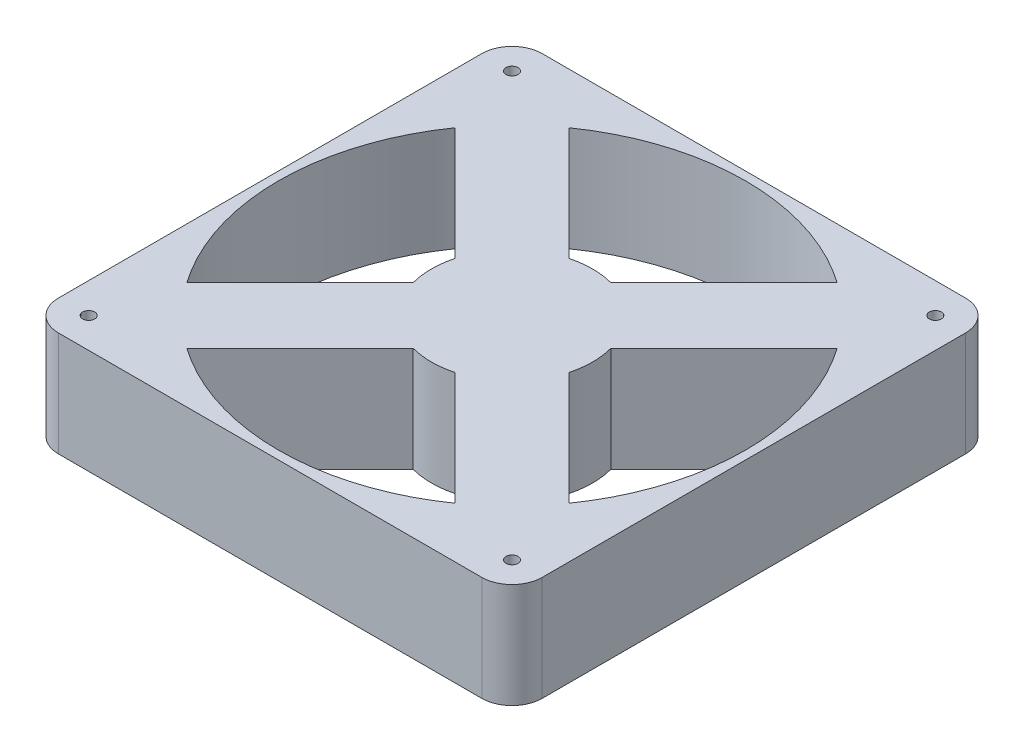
ISO-10303-21;
HEADER;
FILE_DESCRIPTION(('STEP AP214'),'2;1');
FILE_NAME('part.step','',(''),(''),'','','');
FILE_SCHEMA(('AUTOMOTIVE_DESIGN { 1 0 10303 214 1 1 1 1 }'));
ENDSEC;
DATA;
#1=APPLICATION_CONTEXT('core data for automotive mechanical design processes');
#2=APPLICATION_PROTOCOL_DEFINITION('international standard','automotive_design',2000,#1);
#3=PRODUCT_CONTEXT('',#1,'mechanical');
#4=PRODUCT('Part','Part','',(#3));
#5=PRODUCT_RELATED_PRODUCT_CATEGORY('part','',(#4));
#6=PRODUCT_DEFINITION_FORMATION('','',#4);
#7=PRODUCT_DEFINITION_CONTEXT('part definition',#1,'design');
#8=PRODUCT_DEFINITION('design','',#6,#7);
#9=PRODUCT_DEFINITION_SHAPE('','',#8);
#10=(LENGTH_UNIT() NAMED_UNIT(*) SI_UNIT(.MILLI.,.METRE.));
#11=(NAMED_UNIT(*) PLANE_ANGLE_UNIT() SI_UNIT($,.RADIAN.));
#12=(NAMED_UNIT(*) SI_UNIT($,.STERADIAN.) SOLID_ANGLE_UNIT());
#13=UNCERTAINTY_MEASURE_WITH_UNIT(LENGTH_MEASURE(1.E-05),#10,'distance_accuracy_value','');
#14=(GEOMETRIC_REPRESENTATION_CONTEXT(3) GLOBAL_UNCERTAINTY_ASSIGNED_CONTEXT((#13)) GLOBAL_UNIT_ASSIGNED_CONTEXT((#10,
#11,#12)) REPRESENTATION_CONTEXT('',''));
#15=CARTESIAN_POINT('',(0.,0.,0.));
#16=DIRECTION('',(0.,0.,1.));
#17=DIRECTION('',(1.,0.,0.));
#18=AXIS2_PLACEMENT_3D('',#15,#16,#17);
#19=CARTESIAN_POINT('',(-52.5,26.,52.5));
#20=DIRECTION('',(0.,1.,0.));
#21=DIRECTION('',(0.,0.,1.));
#22=AXIS2_PLACEMENT_3D('',#19,#20,#21);
#23=PLANE('',#22);
#24=DIRECTION('',(-0.707106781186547,0.,-0.707106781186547));
#25=VECTOR('',#24,1.);
#26=CARTESIAN_POINT('',(5.17638090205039,26.,19.3185165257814));
#27=LINE('',#26,#25);
#28=CARTESIAN_POINT('',(33.2508237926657,26.,47.3929594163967));
#29=VERTEX_POINT('',#28);
#30=CARTESIAN_POINT('',(5.17638090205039,26.,19.3185165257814));
#31=VERTEX_POINT('',#30);
#32=EDGE_CURVE('E232',#29,#31,#27,.T.);
#33=ORIENTED_EDGE('',*,*,#32,.F.);
#34=CARTESIAN_POINT('',(0.,26.,0.));
#35=DIRECTION('',(0.,1.,0.));
#36=DIRECTION('',(0.,0.,1.));
#37=AXIS2_PLACEMENT_3D('',#34,#35,#36);
#38=CIRCLE('',#37,57.8939537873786);
#39=CARTESIAN_POINT('',(-33.2508237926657,26.,47.3929594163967));
#40=VERTEX_POINT('',#39);
#41=EDGE_CURVE('E230',#40,#29,#38,.T.);
#42=ORIENTED_EDGE('',*,*,#41,.F.);
#43=DIRECTION('',(-0.707106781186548,0.,0.707106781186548));
#44=VECTOR('',#43,1.);
#45=CARTESIAN_POINT('',(-5.17638090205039,26.,19.3185165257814));
#46=LINE('',#45,#44);
#47=CARTESIAN_POINT('',(-5.17638090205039,26.,19.3185165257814));
#48=VERTEX_POINT('',#47);
#49=EDGE_CURVE('E238',#48,#40,#46,.T.);
#50=ORIENTED_EDGE('',*,*,#49,.F.);
#51=CARTESIAN_POINT('',(0.,26.,0.));
#52=DIRECTION('',(0.,-1.,0.));
#53=DIRECTION('',(0.,0.,1.));
#54=AXIS2_PLACEMENT_3D('',#51,#52,#53);
#55=CIRCLE('',#54,20.);
#56=EDGE_CURVE('E235',#31,#48,#55,.T.);
#57=ORIENTED_EDGE('',*,*,#56,.F.);
#58=EDGE_LOOP('',(#33,#42,#50,#57));
#59=FACE_BOUND('',#58,.T.);
#60=CARTESIAN_POINT('',(52.5,26.,52.5));
#61=DIRECTION('',(0.,1.,0.));
#62=DIRECTION('',(0.,0.,1.));
#63=AXIS2_PLACEMENT_3D('',#60,#61,#62);
#64=CIRCLE('',#63,1.5);
#65=CARTESIAN_POINT('',(52.5,26.,51.));
#66=VERTEX_POINT('',#65);
#67=EDGE_CURVE('E292',#66,#66,#64,.T.);
#68=ORIENTED_EDGE('',*,*,#67,.F.);
#69=EDGE_LOOP('',(#68));
#70=FACE_BOUND('',#69,.T.);
#71=CARTESIAN_POINT('',(52.5,26.,-52.5));
#72=DIRECTION('',(0.,1.,0.));
#73=DIRECTION('',(0.,0.,-1.));
#74=AXIS2_PLACEMENT_3D('',#71,#72,#73);
#75=CIRCLE('',#74,1.5);
#76=CARTESIAN_POINT('',(52.5,26.,-54.));
#77=VERTEX_POINT('',#76);
#78=EDGE_CURVE('E304',#77,#77,#75,.T.);
#79=ORIENTED_EDGE('',*,*,#78,.F.);
#80=EDGE_LOOP('',(#79));
#81=FACE_BOUND('',#80,.T.);
#82=DIRECTION('',(0.707106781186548,0.,0.707106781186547));
#83=VECTOR('',#82,1.);
#84=CARTESIAN_POINT('',(19.3185165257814,26.,5.17638090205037));
#85=LINE('',#84,#83);
#86=CARTESIAN_POINT('',(19.3185165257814,26.,5.17638090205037));
#87=VERTEX_POINT('',#86);
#88=CARTESIAN_POINT('',(47.3929594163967,26.,33.2508237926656));
#89=VERTEX_POINT('',#88);
#90=EDGE_CURVE('E318',#87,#89,#85,.T.);
#91=ORIENTED_EDGE('',*,*,#90,.F.);
#92=CARTESIAN_POINT('',(0.,26.,0.));
#93=DIRECTION('',(0.,-1.,0.));
#94=DIRECTION('',(0.,0.,-1.));
#95=AXIS2_PLACEMENT_3D('',#92,#93,#94);
#96=CIRCLE('',#95,20.);
#97=CARTESIAN_POINT('',(19.3185165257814,26.,-5.17638090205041));
#98=VERTEX_POINT('',#97);
#99=EDGE_CURVE('E316',#98,#87,#96,.T.);
#100=ORIENTED_EDGE('',*,*,#99,.F.);
#101=DIRECTION('',(-0.707106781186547,0.,0.707106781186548));
#102=VECTOR('',#101,1.);
#103=CARTESIAN_POINT('',(19.3185165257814,26.,-5.17638090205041));
#104=LINE('',#103,#102);
#105=CARTESIAN_POINT('',(47.3929594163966,26.,-33.2508237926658));
#106=VERTEX_POINT('',#105);
#107=EDGE_CURVE('E324',#106,#98,#104,.T.);
#108=ORIENTED_EDGE('',*,*,#107,.F.);
#109=CARTESIAN_POINT('',(0.,26.,0.));
#110=DIRECTION('',(0.,1.,0.));
#111=DIRECTION('',(0.,0.,-1.));
#112=AXIS2_PLACEMENT_3D('',#109,#110,#111);
#113=CIRCLE('',#112,57.8939537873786);
#114=EDGE_CURVE('E321',#89,#106,#113,.T.);
#115=ORIENTED_EDGE('',*,*,#114,.F.);
#116=EDGE_LOOP('',(#91,#100,#108,#115));
#117=FACE_BOUND('',#116,.T.);
#118=CARTESIAN_POINT('',(-52.5,26.,52.5));
#119=DIRECTION('',(0.,1.,0.));
#120=DIRECTION('',(0.,0.,1.));
#121=AXIS2_PLACEMENT_3D('',#118,#119,#120);
#122=CIRCLE('',#121,7.5);
#123=CARTESIAN_POINT('',(-60.,26.,52.5));
#124=VERTEX_POINT('',#123);
#125=CARTESIAN_POINT('',(-52.5,26.,60.));
#126=VERTEX_POINT('',#125);
#127=EDGE_CURVE('E347',#124,#126,#122,.T.);
#128=ORIENTED_EDGE('',*,*,#127,.T.);
#129=DIRECTION('',(1.,0.,0.));
#130=VECTOR('',#129,1.);
#131=CARTESIAN_POINT('',(-52.5,26.,60.));
#132=LINE('',#131,#130);
#133=CARTESIAN_POINT('',(52.5,26.,60.));
#134=VERTEX_POINT('',#133);
#135=EDGE_CURVE('E350',#126,#134,#132,.T.);
#136=ORIENTED_EDGE('',*,*,#135,.T.);
#137=CARTESIAN_POINT('',(52.5,26.,52.5));
#138=DIRECTION('',(0.,1.,0.));
#139=DIRECTION('',(0.,0.,1.));
#140=AXIS2_PLACEMENT_3D('',#137,#138,#139);
#141=CIRCLE('',#140,7.5);
#142=CARTESIAN_POINT('',(60.,26.,52.5));
#143=VERTEX_POINT('',#142);
#144=EDGE_CURVE('E353',#134,#143,#141,.T.);
#145=ORIENTED_EDGE('',*,*,#144,.T.);
#146=DIRECTION('',(0.,0.,-1.));
#147=VECTOR('',#146,1.);
#148=CARTESIAN_POINT('',(60.,26.,-52.5));
#149=LINE('',#148,#147);
#150=CARTESIAN_POINT('',(60.,26.,-52.5));
#151=VERTEX_POINT('',#150);
#152=EDGE_CURVE('E355',#143,#151,#149,.T.);
#153=ORIENTED_EDGE('',*,*,#152,.T.);
#154=CARTESIAN_POINT('',(52.5,26.,-52.5));
#155=DIRECTION('',(0.,1.,0.));
#156=DIRECTION('',(0.,0.,-1.));
#157=AXIS2_PLACEMENT_3D('',#154,#155,#156);
#158=CIRCLE('',#157,7.5);
#159=CARTESIAN_POINT('',(52.5,26.,-60.));
#160=VERTEX_POINT('',#159);
#161=EDGE_CURVE('E357',#151,#160,#158,.T.);
#162=ORIENTED_EDGE('',*,*,#161,.T.);
#163=DIRECTION('',(-1.,0.,0.));
#164=VECTOR('',#163,1.);
#165=CARTESIAN_POINT('',(-52.5,26.,-60.));
#166=LINE('',#165,#164);
#167=CARTESIAN_POINT('',(-52.5,26.,-60.));
#168=VERTEX_POINT('',#167);
#169=EDGE_CURVE('E359',#160,#168,#166,.T.);
#170=ORIENTED_EDGE('',*,*,#169,.T.);
#171=CARTESIAN_POINT('',(-52.5,26.,-52.5));
#172=DIRECTION('',(0.,1.,0.));
#173=DIRECTION('',(0.,0.,-1.));
#174=AXIS2_PLACEMENT_3D('',#171,#172,#173);
#175=CIRCLE('',#174,7.5);
#176=CARTESIAN_POINT('',(-60.,26.,-52.5));
#177=VERTEX_POINT('',#176);
#178=EDGE_CURVE('E361',#168,#177,#175,.T.);
#179=ORIENTED_EDGE('',*,*,#178,.T.);
#180=DIRECTION('',(0.,0.,1.));
#181=VECTOR('',#180,1.);
#182=CARTESIAN_POINT('',(-60.,26.,-52.5));
#183=LINE('',#182,#181);
#184=EDGE_CURVE('E363',#177,#124,#183,.T.);
#185=ORIENTED_EDGE('',*,*,#184,.T.);
#186=EDGE_LOOP('',(#128,#136,#145,#153,#162,#170,#179,#185));
#187=FACE_BOUND('',#186,.T.);
#188=CARTESIAN_POINT('',(-52.5,26.,-52.5));
#189=DIRECTION('',(0.,1.,0.));
#190=DIRECTION('',(0.,0.,1.));
#191=AXIS2_PLACEMENT_3D('',#188,#189,#190);
#192=CIRCLE('',#191,1.5);
#193=CARTESIAN_POINT('',(-52.5,26.,-54.));
#194=VERTEX_POINT('',#193);
#195=EDGE_CURVE('E310',#194,#194,#192,.T.);
#196=ORIENTED_EDGE('',*,*,#195,.F.);
#197=EDGE_LOOP('',(#196));
#198=FACE_BOUND('',#197,.T.);
#199=CARTESIAN_POINT('',(-52.5,26.,52.5));
#200=DIRECTION('',(0.,1.,0.));
#201=DIRECTION('',(0.,0.,-1.));
#202=AXIS2_PLACEMENT_3D('',#199,#200,#201);
#203=CIRCLE('',#202,1.49999999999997);
#204=CARTESIAN_POINT('',(-52.5,26.,51.));
#205=VERTEX_POINT('',#204);
#206=EDGE_CURVE('E298',#205,#205,#203,.T.);
#207=ORIENTED_EDGE('',*,*,#206,.F.);
#208=EDGE_LOOP('',(#207));
#209=FACE_BOUND('',#208,.T.);
#210=DIRECTION('',(0.707106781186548,0.,0.707106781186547));
#211=VECTOR('',#210,1.);
#212=CARTESIAN_POINT('',(-33.2508237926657,26.,-47.3929594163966));
#213=LINE('',#212,#211);
#214=CARTESIAN_POINT('',(-33.2508237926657,26.,-47.3929594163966));
#215=VERTEX_POINT('',#214);
#216=CARTESIAN_POINT('',(-5.17638090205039,26.,-19.3185165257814));
#217=VERTEX_POINT('',#216);
#218=EDGE_CURVE('E263',#215,#217,#213,.T.);
#219=ORIENTED_EDGE('',*,*,#218,.F.);
#220=CARTESIAN_POINT('',(0.,26.,0.));
#221=DIRECTION('',(0.,1.,0.));
#222=DIRECTION('',(0.,0.,-1.));
#223=AXIS2_PLACEMENT_3D('',#220,#221,#222);
#224=CIRCLE('',#223,57.8939537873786);
#225=CARTESIAN_POINT('',(33.2508237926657,26.,-47.3929594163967));
#226=VERTEX_POINT('',#225);
#227=EDGE_CURVE('E261',#226,#215,#224,.T.);
#228=ORIENTED_EDGE('',*,*,#227,.F.);
#229=DIRECTION('',(0.707106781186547,0.,-0.707106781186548));
#230=VECTOR('',#229,1.);
#231=CARTESIAN_POINT('',(5.17638090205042,26.,-19.3185165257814));
#232=LINE('',#231,#230);
#233=CARTESIAN_POINT('',(5.17638090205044,26.,-19.3185165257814));
#234=VERTEX_POINT('',#233);
#235=EDGE_CURVE('E269',#234,#226,#232,.T.);
#236=ORIENTED_EDGE('',*,*,#235,.F.);
#237=CARTESIAN_POINT('',(0.,26.,0.));
#238=DIRECTION('',(0.,-1.,0.));
#239=DIRECTION('',(0.,0.,-1.));
#240=AXIS2_PLACEMENT_3D('',#237,#238,#239);
#241=CIRCLE('',#240,20.);
#242=EDGE_CURVE('E266',#217,#234,#241,.T.);
#243=ORIENTED_EDGE('',*,*,#242,.F.);
#244=EDGE_LOOP('',(#219,#228,#236,#243));
#245=FACE_BOUND('',#244,.T.);
#246=DIRECTION('',(0.707106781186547,0.,-0.707106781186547));
#247=VECTOR('',#246,1.);
#248=CARTESIAN_POINT('',(-19.3185165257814,26.,5.17638090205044));
#249=LINE('',#248,#247);
#250=CARTESIAN_POINT('',(-47.3929594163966,26.,33.2508237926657));
#251=VERTEX_POINT('',#250);
#252=CARTESIAN_POINT('',(-19.3185165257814,26.,5.17638090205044));
#253=VERTEX_POINT('',#252);
#254=EDGE_CURVE('E202',#251,#253,#249,.T.);
#255=ORIENTED_EDGE('',*,*,#254,.F.);
#256=CARTESIAN_POINT('',(0.,26.,0.));
#257=DIRECTION('',(0.,1.,0.));
#258=DIRECTION('',(0.,0.,1.));
#259=AXIS2_PLACEMENT_3D('',#256,#257,#258);
#260=CIRCLE('',#259,57.8939537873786);
#261=CARTESIAN_POINT('',(-47.3929594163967,26.,-33.2508237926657));
#262=VERTEX_POINT('',#261);
#263=EDGE_CURVE('E194',#262,#251,#260,.T.);
#264=ORIENTED_EDGE('',*,*,#263,.F.);
#265=DIRECTION('',(-0.707106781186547,0.,-0.707106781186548));
#266=VECTOR('',#265,1.);
#267=CARTESIAN_POINT('',(-47.3929594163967,26.,-33.2508237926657));
#268=LINE('',#267,#266);
#269=CARTESIAN_POINT('',(-19.3185165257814,26.,-5.1763809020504));
#270=VERTEX_POINT('',#269);
#271=EDGE_CURVE('E216',#270,#262,#268,.T.);
#272=ORIENTED_EDGE('',*,*,#271,.F.);
#273=CARTESIAN_POINT('',(0.,26.,0.));
#274=DIRECTION('',(0.,-1.,0.));
#275=DIRECTION('',(0.,0.,1.));
#276=AXIS2_PLACEMENT_3D('',#273,#274,#275);
#277=CIRCLE('',#276,20.);
#278=EDGE_CURVE('E214',#253,#270,#277,.T.);
#279=ORIENTED_EDGE('',*,*,#278,.F.);
#280=EDGE_LOOP('',(#255,#264,#272,#279));
#281=FACE_BOUND('',#280,.T.);
#282=ADVANCED_FACE('F33',(#59,#70,#81,#117,#187,#198,#209,#245,#281),#23,.T.);
#283=CARTESIAN_POINT('',(-52.5,0.,52.5));
#284=DIRECTION('',(0.,1.,0.));
#285=DIRECTION('',(0.,0.,1.));
#286=AXIS2_PLACEMENT_3D('',#283,#284,#285);
#287=PLANE('',#286);
#288=CARTESIAN_POINT('',(0.,0.,0.));
#289=DIRECTION('',(0.,1.,0.));
#290=DIRECTION('',(0.,0.,1.));
#291=AXIS2_PLACEMENT_3D('',#288,#289,#290);
#292=CIRCLE('',#291,57.8939537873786);
#293=CARTESIAN_POINT('',(-33.2508237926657,0.,47.3929594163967));
#294=VERTEX_POINT('',#293);
#295=CARTESIAN_POINT('',(33.2508237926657,0.,47.3929594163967));
#296=VERTEX_POINT('',#295);
#297=EDGE_CURVE('E210',#294,#296,#292,.T.);
#298=ORIENTED_EDGE('',*,*,#297,.T.);
#299=DIRECTION('',(-0.707106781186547,0.,-0.707106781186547));
#300=VECTOR('',#299,1.);
#301=CARTESIAN_POINT('',(5.17638090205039,0.,19.3185165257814));
#302=LINE('',#301,#300);
#303=CARTESIAN_POINT('',(5.17638090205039,0.,19.3185165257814));
#304=VERTEX_POINT('',#303);
#305=EDGE_CURVE('E243',#296,#304,#302,.T.);
#306=ORIENTED_EDGE('',*,*,#305,.T.);
#307=CARTESIAN_POINT('',(0.,0.,0.));
#308=DIRECTION('',(0.,-1.,0.));
#309=DIRECTION('',(0.,0.,1.));
#310=AXIS2_PLACEMENT_3D('',#307,#308,#309);
#311=CIRCLE('',#310,20.);
#312=CARTESIAN_POINT('',(-5.17638090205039,0.,19.3185165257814));
#313=VERTEX_POINT('',#312);
#314=EDGE_CURVE('E246',#304,#313,#311,.T.);
#315=ORIENTED_EDGE('',*,*,#314,.T.);
#316=DIRECTION('',(-0.707106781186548,0.,0.707106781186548));
#317=VECTOR('',#316,1.);
#318=CARTESIAN_POINT('',(-5.17638090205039,0.,19.3185165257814));
#319=LINE('',#318,#317);
#320=EDGE_CURVE('E233',#313,#294,#319,.T.);
#321=ORIENTED_EDGE('',*,*,#320,.T.);
#322=EDGE_LOOP('',(#298,#306,#315,#321));
#323=FACE_BOUND('',#322,.T.);
#324=CARTESIAN_POINT('',(52.5,0.,52.5));
#325=DIRECTION('',(0.,1.,0.));
#326=DIRECTION('',(0.,0.,1.));
#327=AXIS2_PLACEMENT_3D('',#324,#325,#326);
#328=CIRCLE('',#327,1.5);
#329=CARTESIAN_POINT('',(52.5,0.,51.));
#330=VERTEX_POINT('',#329);
#331=EDGE_CURVE('E291',#330,#330,#328,.T.);
#332=ORIENTED_EDGE('',*,*,#331,.T.);
#333=EDGE_LOOP('',(#332));
#334=FACE_BOUND('',#333,.T.);
#335=CARTESIAN_POINT('',(52.5,0.,-52.5));
#336=DIRECTION('',(0.,1.,0.));
#337=DIRECTION('',(0.,0.,-1.));
#338=AXIS2_PLACEMENT_3D('',#335,#336,#337);
#339=CIRCLE('',#338,1.5);
#340=CARTESIAN_POINT('',(52.5,0.,-54.));
#341=VERTEX_POINT('',#340);
#342=EDGE_CURVE('E301',#341,#341,#339,.T.);
#343=ORIENTED_EDGE('',*,*,#342,.T.);
#344=EDGE_LOOP('',(#343));
#345=FACE_BOUND('',#344,.T.);
#346=CARTESIAN_POINT('',(0.,0.,0.));
#347=DIRECTION('',(0.,-1.,0.));
#348=DIRECTION('',(0.,0.,-1.));
#349=AXIS2_PLACEMENT_3D('',#346,#347,#348);
#350=CIRCLE('',#349,20.);
#351=CARTESIAN_POINT('',(19.3185165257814,0.,-5.17638090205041));
#352=VERTEX_POINT('',#351);
#353=CARTESIAN_POINT('',(19.3185165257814,0.,5.17638090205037));
#354=VERTEX_POINT('',#353);
#355=EDGE_CURVE('E313',#352,#354,#350,.T.);
#356=ORIENTED_EDGE('',*,*,#355,.T.);
#357=DIRECTION('',(0.707106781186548,0.,0.707106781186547));
#358=VECTOR('',#357,1.);
#359=CARTESIAN_POINT('',(19.3185165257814,0.,5.17638090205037));
#360=LINE('',#359,#358);
#361=CARTESIAN_POINT('',(47.3929594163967,0.,33.2508237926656));
#362=VERTEX_POINT('',#361);
#363=EDGE_CURVE('E329',#354,#362,#360,.T.);
#364=ORIENTED_EDGE('',*,*,#363,.T.);
#365=CARTESIAN_POINT('',(0.,0.,0.));
#366=DIRECTION('',(0.,1.,0.));
#367=DIRECTION('',(0.,0.,-1.));
#368=AXIS2_PLACEMENT_3D('',#365,#366,#367);
#369=CIRCLE('',#368,57.8939537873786);
#370=CARTESIAN_POINT('',(47.3929594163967,0.,-33.2508237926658));
#371=VERTEX_POINT('',#370);
#372=EDGE_CURVE('E332',#362,#371,#369,.T.);
#373=ORIENTED_EDGE('',*,*,#372,.T.);
#374=DIRECTION('',(-0.707106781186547,0.,0.707106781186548));
#375=VECTOR('',#374,1.);
#376=CARTESIAN_POINT('',(19.3185165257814,0.,-5.17638090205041));
#377=LINE('',#376,#375);
#378=EDGE_CURVE('E319',#371,#352,#377,.T.);
#379=ORIENTED_EDGE('',*,*,#378,.T.);
#380=EDGE_LOOP('',(#356,#364,#373,#379));
#381=FACE_BOUND('',#380,.T.);
#382=CARTESIAN_POINT('',(-52.5,0.,52.5));
#383=DIRECTION('',(0.,1.,0.));
#384=DIRECTION('',(0.,0.,1.));
#385=AXIS2_PLACEMENT_3D('',#382,#383,#384);
#386=CIRCLE('',#385,7.5);
#387=CARTESIAN_POINT('',(-60.,0.,52.5));
#388=VERTEX_POINT('',#387);
#389=CARTESIAN_POINT('',(-52.5,0.,60.));
#390=VERTEX_POINT('',#389);
#391=EDGE_CURVE('E346',#388,#390,#386,.T.);
#392=ORIENTED_EDGE('',*,*,#391,.F.);
#393=DIRECTION('',(0.,0.,1.));
#394=VECTOR('',#393,1.);
#395=CARTESIAN_POINT('',(-60.,0.,-52.5));
#396=LINE('',#395,#394);
#397=CARTESIAN_POINT('',(-60.,0.,-52.5));
#398=VERTEX_POINT('',#397);
#399=EDGE_CURVE('E351',#398,#388,#396,.T.);
#400=ORIENTED_EDGE('',*,*,#399,.F.);
#401=CARTESIAN_POINT('',(-52.5,0.,-52.5));
#402=DIRECTION('',(0.,1.,0.));
#403=DIRECTION('',(0.,0.,-1.));
#404=AXIS2_PLACEMENT_3D('',#401,#402,#403);
#405=CIRCLE('',#404,7.5);
#406=CARTESIAN_POINT('',(-52.5,0.,-60.));
#407=VERTEX_POINT('',#406);
#408=EDGE_CURVE('E378',#407,#398,#405,.T.);
#409=ORIENTED_EDGE('',*,*,#408,.F.);
#410=DIRECTION('',(-1.,0.,0.));
#411=VECTOR('',#410,1.);
#412=CARTESIAN_POINT('',(-52.5,0.,-60.));
#413=LINE('',#412,#411);
#414=CARTESIAN_POINT('',(52.5,0.,-60.));
#415=VERTEX_POINT('',#414);
#416=EDGE_CURVE('E376',#415,#407,#413,.T.);
#417=ORIENTED_EDGE('',*,*,#416,.F.);
#418=CARTESIAN_POINT('',(52.5,0.,-52.5));
#419=DIRECTION('',(0.,1.,0.));
#420=DIRECTION('',(0.,0.,-1.));
#421=AXIS2_PLACEMENT_3D('',#418,#419,#420);
#422=CIRCLE('',#421,7.5);
#423=CARTESIAN_POINT('',(60.,0.,-52.5));
#424=VERTEX_POINT('',#423);
#425=EDGE_CURVE('E374',#424,#415,#422,.T.);
#426=ORIENTED_EDGE('',*,*,#425,.F.);
#427=DIRECTION('',(0.,0.,-1.));
#428=VECTOR('',#427,1.);
#429=CARTESIAN_POINT('',(60.,0.,-52.5));
#430=LINE('',#429,#428);
#431=CARTESIAN_POINT('',(60.,0.,52.5));
#432=VERTEX_POINT('',#431);
#433=EDGE_CURVE('E372',#432,#424,#430,.T.);
#434=ORIENTED_EDGE('',*,*,#433,.F.);
#435=CARTESIAN_POINT('',(52.5,0.,52.5));
#436=DIRECTION('',(0.,1.,0.));
#437=DIRECTION('',(0.,0.,1.));
#438=AXIS2_PLACEMENT_3D('',#435,#436,#437);
#439=CIRCLE('',#438,7.5);
#440=CARTESIAN_POINT('',(52.5,0.,60.));
#441=VERTEX_POINT('',#440);
#442=EDGE_CURVE('E370',#441,#432,#439,.T.);
#443=ORIENTED_EDGE('',*,*,#442,.F.);
#444=DIRECTION('',(1.,0.,0.));
#445=VECTOR('',#444,1.);
#446=CARTESIAN_POINT('',(-52.5,0.,60.));
#447=LINE('',#446,#445);
#448=EDGE_CURVE('E368',#390,#441,#447,.T.);
#449=ORIENTED_EDGE('',*,*,#448,.F.);
#450=EDGE_LOOP('',(#392,#400,#409,#417,#426,#434,#443,#449));
#451=FACE_BOUND('',#450,.T.);
#452=CARTESIAN_POINT('',(-52.5,0.,-52.5));
#453=DIRECTION('',(0.,1.,0.));
#454=DIRECTION('',(0.,0.,1.));
#455=AXIS2_PLACEMENT_3D('',#452,#453,#454);
#456=CIRCLE('',#455,1.5);
#457=CARTESIAN_POINT('',(-52.5,0.,-54.));
#458=VERTEX_POINT('',#457);
#459=EDGE_CURVE('E307',#458,#458,#456,.T.);
#460=ORIENTED_EDGE('',*,*,#459,.T.);
#461=EDGE_LOOP('',(#460));
#462=FACE_BOUND('',#461,.T.);
#463=CARTESIAN_POINT('',(-52.5,0.,52.5));
#464=DIRECTION('',(0.,1.,0.));
#465=DIRECTION('',(0.,0.,-1.));
#466=AXIS2_PLACEMENT_3D('',#463,#464,#465);
#467=CIRCLE('',#466,1.49999999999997);
#468=CARTESIAN_POINT('',(-52.5,0.,51.));
#469=VERTEX_POINT('',#468);
#470=EDGE_CURVE('E295',#469,#469,#467,.T.);
#471=ORIENTED_EDGE('',*,*,#470,.T.);
#472=EDGE_LOOP('',(#471));
#473=FACE_BOUND('',#472,.T.);
#474=CARTESIAN_POINT('',(0.,0.,0.));
#475=DIRECTION('',(0.,1.,0.));
#476=DIRECTION('',(0.,0.,-1.));
#477=AXIS2_PLACEMENT_3D('',#474,#475,#476);
#478=CIRCLE('',#477,57.8939537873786);
#479=CARTESIAN_POINT('',(33.2508237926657,0.,-47.3929594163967));
#480=VERTEX_POINT('',#479);
#481=CARTESIAN_POINT('',(-33.2508237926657,0.,-47.3929594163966));
#482=VERTEX_POINT('',#481);
#483=EDGE_CURVE('E260',#480,#482,#478,.T.);
#484=ORIENTED_EDGE('',*,*,#483,.T.);
#485=DIRECTION('',(0.707106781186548,0.,0.707106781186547));
#486=VECTOR('',#485,1.);
#487=CARTESIAN_POINT('',(-33.2508237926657,0.,-47.3929594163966));
#488=LINE('',#487,#486);
#489=CARTESIAN_POINT('',(-5.17638090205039,0.,-19.3185165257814));
#490=VERTEX_POINT('',#489);
#491=EDGE_CURVE('E274',#482,#490,#488,.T.);
#492=ORIENTED_EDGE('',*,*,#491,.T.);
#493=CARTESIAN_POINT('',(0.,0.,0.));
#494=DIRECTION('',(0.,-1.,0.));
#495=DIRECTION('',(0.,0.,-1.));
#496=AXIS2_PLACEMENT_3D('',#493,#494,#495);
#497=CIRCLE('',#496,20.);
#498=CARTESIAN_POINT('',(5.17638090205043,0.,-19.3185165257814));
#499=VERTEX_POINT('',#498);
#500=EDGE_CURVE('E277',#490,#499,#497,.T.);
#501=ORIENTED_EDGE('',*,*,#500,.T.);
#502=DIRECTION('',(0.707106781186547,0.,-0.707106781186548));
#503=VECTOR('',#502,1.);
#504=CARTESIAN_POINT('',(5.17638090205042,0.,-19.3185165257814));
#505=LINE('',#504,#503);
#506=EDGE_CURVE('E264',#499,#480,#505,.T.);
#507=ORIENTED_EDGE('',*,*,#506,.T.);
#508=EDGE_LOOP('',(#484,#492,#501,#507));
#509=FACE_BOUND('',#508,.T.);
#510=CARTESIAN_POINT('',(0.,0.,0.));
#511=DIRECTION('',(0.,1.,0.));
#512=DIRECTION('',(0.,0.,1.));
#513=AXIS2_PLACEMENT_3D('',#510,#511,#512);
#514=CIRCLE('',#513,57.8939537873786);
#515=CARTESIAN_POINT('',(-47.3929594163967,0.,-33.2508237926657));
#516=VERTEX_POINT('',#515);
#517=CARTESIAN_POINT('',(-47.3929594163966,0.,33.2508237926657));
#518=VERTEX_POINT('',#517);
#519=EDGE_CURVE('E56',#516,#518,#514,.T.);
#520=ORIENTED_EDGE('',*,*,#519,.T.);
#521=DIRECTION('',(0.707106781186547,0.,-0.707106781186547));
#522=VECTOR('',#521,1.);
#523=CARTESIAN_POINT('',(-19.3185165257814,0.,5.17638090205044));
#524=LINE('',#523,#522);
#525=CARTESIAN_POINT('',(-19.3185165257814,0.,5.17638090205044));
#526=VERTEX_POINT('',#525);
#527=EDGE_CURVE('E209',#518,#526,#524,.T.);
#528=ORIENTED_EDGE('',*,*,#527,.T.);
#529=CARTESIAN_POINT('',(0.,0.,0.));
#530=DIRECTION('',(0.,-1.,0.));
#531=DIRECTION('',(0.,0.,1.));
#532=AXIS2_PLACEMENT_3D('',#529,#530,#531);
#533=CIRCLE('',#532,20.);
#534=CARTESIAN_POINT('',(-19.3185165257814,0.,-5.17638090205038));
#535=VERTEX_POINT('',#534);
#536=EDGE_CURVE('E222',#526,#535,#533,.T.);
#537=ORIENTED_EDGE('',*,*,#536,.T.);
#538=DIRECTION('',(-0.707106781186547,0.,-0.707106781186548));
#539=VECTOR('',#538,1.);
#540=CARTESIAN_POINT('',(-47.3929594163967,0.,-33.2508237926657));
#541=LINE('',#540,#539);
#542=EDGE_CURVE('E203',#535,#516,#541,.T.);
#543=ORIENTED_EDGE('',*,*,#542,.T.);
#544=EDGE_LOOP('',(#520,#528,#537,#543));
#545=FACE_BOUND('',#544,.T.);
#546=ADVANCED_FACE('F408',(#323,#334,#345,#381,#451,#462,#473,#509,#545),#287,.F.);
#547=CARTESIAN_POINT('',(-52.5,26.,52.5));
#548=DIRECTION('',(0.,-1.,0.));
#549=DIRECTION('',(0.,0.,-1.));
#550=AXIS2_PLACEMENT_3D('',#547,#548,#549);
#551=CYLINDRICAL_SURFACE('',#550,7.5);
#552=ORIENTED_EDGE('',*,*,#391,.T.);
#553=DIRECTION('',(0.,-1.,0.));
#554=VECTOR('',#553,1.);
#555=CARTESIAN_POINT('',(-52.5,26.,60.));
#556=LINE('',#555,#554);
#557=EDGE_CURVE('E11',#126,#390,#556,.T.);
#558=ORIENTED_EDGE('',*,*,#557,.F.);
#559=ORIENTED_EDGE('',*,*,#127,.F.);
#560=DIRECTION('',(0.,-1.,0.));
#561=VECTOR('',#560,1.);
#562=CARTESIAN_POINT('',(-60.,26.,52.5));
#563=LINE('',#562,#561);
#564=EDGE_CURVE('E365',#124,#388,#563,.T.);
#565=ORIENTED_EDGE('',*,*,#564,.T.);
#566=EDGE_LOOP('',(#552,#558,#559,#565));
#567=FACE_BOUND('',#566,.T.);
#568=ADVANCED_FACE('F35',(#567),#551,.T.);
#569=CARTESIAN_POINT('',(-52.5,26.,60.));
#570=DIRECTION('',(0.,0.,-1.));
#571=DIRECTION('',(-1.,0.,0.));
#572=AXIS2_PLACEMENT_3D('',#569,#570,#571);
#573=PLANE('',#572);
#574=ORIENTED_EDGE('',*,*,#448,.T.);
#575=DIRECTION('',(0.,-1.,0.));
#576=VECTOR('',#575,1.);
#577=CARTESIAN_POINT('',(52.5,26.,60.));
#578=LINE('',#577,#576);
#579=EDGE_CURVE('E41',#134,#441,#578,.T.);
#580=ORIENTED_EDGE('',*,*,#579,.F.);
#581=ORIENTED_EDGE('',*,*,#135,.F.);
#582=ORIENTED_EDGE('',*,*,#557,.T.);
#583=EDGE_LOOP('',(#574,#580,#581,#582));
#584=FACE_BOUND('',#583,.T.);
#585=ADVANCED_FACE('F426',(#584),#573,.F.);
#586=CARTESIAN_POINT('',(52.5,26.,52.5));
#587=DIRECTION('',(0.,-1.,0.));
#588=DIRECTION('',(0.,0.,-1.));
#589=AXIS2_PLACEMENT_3D('',#586,#587,#588);
#590=CYLINDRICAL_SURFACE('',#589,7.5);
#591=ORIENTED_EDGE('',*,*,#442,.T.);
#592=DIRECTION('',(0.,-1.,0.));
#593=VECTOR('',#592,1.);
#594=CARTESIAN_POINT('',(60.,26.,52.5));
#595=LINE('',#594,#593);
#596=EDGE_CURVE('E395',#143,#432,#595,.T.);
#597=ORIENTED_EDGE('',*,*,#596,.F.);
#598=ORIENTED_EDGE('',*,*,#144,.F.);
#599=ORIENTED_EDGE('',*,*,#579,.T.);
#600=EDGE_LOOP('',(#591,#597,#598,#599));
#601=FACE_BOUND('',#600,.T.);
#602=ADVANCED_FACE('F402',(#601),#590,.T.);
#603=CARTESIAN_POINT('',(60.,26.,-52.5));
#604=DIRECTION('',(-1.,0.,0.));
#605=DIRECTION('',(0.,0.,1.));
#606=AXIS2_PLACEMENT_3D('',#603,#604,#605);
#607=PLANE('',#606);
#608=ORIENTED_EDGE('',*,*,#433,.T.);
#609=DIRECTION('',(0.,-1.,0.));
#610=VECTOR('',#609,1.);
#611=CARTESIAN_POINT('',(60.,26.,-52.5));
#612=LINE('',#611,#610);
#613=EDGE_CURVE('E392',#151,#424,#612,.T.);
#614=ORIENTED_EDGE('',*,*,#613,.F.);
#615=ORIENTED_EDGE('',*,*,#152,.F.);
#616=ORIENTED_EDGE('',*,*,#596,.T.);
#617=EDGE_LOOP('',(#608,#614,#615,#616));
#618=FACE_BOUND('',#617,.T.);
#619=ADVANCED_FACE('F414',(#618),#607,.F.);
#620=CARTESIAN_POINT('',(52.5,26.,-52.5));
#621=DIRECTION('',(0.,-1.,0.));
#622=DIRECTION('',(0.,0.,-1.));
#623=AXIS2_PLACEMENT_3D('',#620,#621,#622);
#624=CYLINDRICAL_SURFACE('',#623,7.5);
#625=ORIENTED_EDGE('',*,*,#425,.T.);
#626=DIRECTION('',(0.,-1.,0.));
#627=VECTOR('',#626,1.);
#628=CARTESIAN_POINT('',(52.5,26.,-60.));
#629=LINE('',#628,#627);
#630=EDGE_CURVE('E389',#160,#415,#629,.T.);
#631=ORIENTED_EDGE('',*,*,#630,.F.);
#632=ORIENTED_EDGE('',*,*,#161,.F.);
#633=ORIENTED_EDGE('',*,*,#613,.T.);
#634=EDGE_LOOP('',(#625,#631,#632,#633));
#635=FACE_BOUND('',#634,.T.);
#636=ADVANCED_FACE('F418',(#635),#624,.T.);
#637=CARTESIAN_POINT('',(-52.5,26.,-60.));
#638=DIRECTION('',(0.,0.,1.));
#639=DIRECTION('',(1.,0.,0.));
#640=AXIS2_PLACEMENT_3D('',#637,#638,#639);
#641=PLANE('',#640);
#642=ORIENTED_EDGE('',*,*,#416,.T.);
#643=DIRECTION('',(0.,-1.,0.));
#644=VECTOR('',#643,1.);
#645=CARTESIAN_POINT('',(-52.5,26.,-60.));
#646=LINE('',#645,#644);
#647=EDGE_CURVE('E386',#168,#407,#646,.T.);
#648=ORIENTED_EDGE('',*,*,#647,.F.);
#649=ORIENTED_EDGE('',*,*,#169,.F.);
#650=ORIENTED_EDGE('',*,*,#630,.T.);
#651=EDGE_LOOP('',(#642,#648,#649,#650));
#652=FACE_BOUND('',#651,.T.);
#653=ADVANCED_FACE('F439',(#652),#641,.F.);
#654=CARTESIAN_POINT('',(-52.5,26.,-52.5));
#655=DIRECTION('',(0.,-1.,0.));
#656=DIRECTION('',(0.,0.,-1.));
#657=AXIS2_PLACEMENT_3D('',#654,#655,#656);
#658=CYLINDRICAL_SURFACE('',#657,7.5);
#659=ORIENTED_EDGE('',*,*,#408,.T.);
#660=DIRECTION('',(0.,-1.,0.));
#661=VECTOR('',#660,1.);
#662=CARTESIAN_POINT('',(-60.,26.,-52.5));
#663=LINE('',#662,#661);
#664=EDGE_CURVE('E383',#177,#398,#663,.T.);
#665=ORIENTED_EDGE('',*,*,#664,.F.);
#666=ORIENTED_EDGE('',*,*,#178,.F.);
#667=ORIENTED_EDGE('',*,*,#647,.T.);
#668=EDGE_LOOP('',(#659,#665,#666,#667));
#669=FACE_BOUND('',#668,.T.);
#670=ADVANCED_FACE('F437',(#669),#658,.T.);
#671=CARTESIAN_POINT('',(-60.,26.,-52.5));
#672=DIRECTION('',(1.,0.,0.));
#673=DIRECTION('',(0.,0.,-1.));
#674=AXIS2_PLACEMENT_3D('',#671,#672,#673);
#675=PLANE('',#674);
#676=ORIENTED_EDGE('',*,*,#399,.T.);
#677=ORIENTED_EDGE('',*,*,#564,.F.);
#678=ORIENTED_EDGE('',*,*,#184,.F.);
#679=ORIENTED_EDGE('',*,*,#664,.T.);
#680=EDGE_LOOP('',(#676,#677,#678,#679));
#681=FACE_BOUND('',#680,.T.);
#682=ADVANCED_FACE('F432',(#681),#675,.F.);
#683=CARTESIAN_POINT('',(0.,26.,0.));
#684=DIRECTION('',(0.,-1.,0.));
#685=DIRECTION('',(0.,0.,-1.));
#686=AXIS2_PLACEMENT_3D('',#683,#684,#685);
#687=CYLINDRICAL_SURFACE('',#686,20.);
#688=ORIENTED_EDGE('',*,*,#355,.F.);
#689=DIRECTION('',(0.,-1.,0.));
#690=VECTOR('',#689,1.);
#691=CARTESIAN_POINT('',(19.3185165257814,26.,-5.17638090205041));
#692=LINE('',#691,#690);
#693=EDGE_CURVE('E326',#98,#352,#692,.T.);
#694=ORIENTED_EDGE('',*,*,#693,.F.);
#695=ORIENTED_EDGE('',*,*,#99,.T.);
#696=DIRECTION('',(0.,-1.,0.));
#697=VECTOR('',#696,1.);
#698=CARTESIAN_POINT('',(19.3185165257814,26.,5.17638090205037));
#699=LINE('',#698,#697);
#700=EDGE_CURVE('E343',#87,#354,#699,.T.);
#701=ORIENTED_EDGE('',*,*,#700,.T.);
#702=EDGE_LOOP('',(#688,#694,#695,#701));
#703=FACE_BOUND('',#702,.T.);
#704=ADVANCED_FACE('F459',(#703),#687,.T.);
#705=CARTESIAN_POINT('',(19.3185165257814,26.,5.17638090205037));
#706=DIRECTION('',(0.707106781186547,0.,-0.707106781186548));
#707=DIRECTION('',(-0.707106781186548,0.,-0.707106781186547));
#708=AXIS2_PLACEMENT_3D('',#705,#706,#707);
#709=PLANE('',#708);
#710=ORIENTED_EDGE('',*,*,#363,.F.);
#711=ORIENTED_EDGE('',*,*,#700,.F.);
#712=ORIENTED_EDGE('',*,*,#90,.T.);
#713=DIRECTION('',(0.,-1.,0.));
#714=VECTOR('',#713,1.);
#715=CARTESIAN_POINT('',(47.3929594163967,26.,33.2508237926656));
#716=LINE('',#715,#714);
#717=EDGE_CURVE('E341',#89,#362,#716,.T.);
#718=ORIENTED_EDGE('',*,*,#717,.T.);
#719=EDGE_LOOP('',(#710,#711,#712,#718));
#720=FACE_BOUND('',#719,.T.);
#721=ADVANCED_FACE('F466',(#720),#709,.T.);
#722=CARTESIAN_POINT('',(0.,26.,0.));
#723=DIRECTION('',(0.,-1.,0.));
#724=DIRECTION('',(0.,0.,-1.));
#725=AXIS2_PLACEMENT_3D('',#722,#723,#724);
#726=CYLINDRICAL_SURFACE('',#725,57.8939537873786);
#727=ORIENTED_EDGE('',*,*,#372,.F.);
#728=ORIENTED_EDGE('',*,*,#717,.F.);
#729=ORIENTED_EDGE('',*,*,#114,.T.);
#730=DIRECTION('',(0.,-1.,0.));
#731=VECTOR('',#730,1.);
#732=CARTESIAN_POINT('',(47.3929594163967,26.,-33.2508237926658));
#733=LINE('',#732,#731);
#734=EDGE_CURVE('E339',#106,#371,#733,.T.);
#735=ORIENTED_EDGE('',*,*,#734,.T.);
#736=EDGE_LOOP('',(#727,#728,#729,#735));
#737=FACE_BOUND('',#736,.T.);
#738=ADVANCED_FACE('F471',(#737),#726,.F.);
#739=CARTESIAN_POINT('',(19.3185165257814,26.,-5.17638090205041));
#740=DIRECTION('',(0.707106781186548,0.,0.707106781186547));
#741=DIRECTION('',(0.707106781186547,0.,-0.707106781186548));
#742=AXIS2_PLACEMENT_3D('',#739,#740,#741);
#743=PLANE('',#742);
#744=ORIENTED_EDGE('',*,*,#378,.F.);
#745=ORIENTED_EDGE('',*,*,#734,.F.);
#746=ORIENTED_EDGE('',*,*,#107,.T.);
#747=ORIENTED_EDGE('',*,*,#693,.T.);
#748=EDGE_LOOP('',(#744,#745,#746,#747));
#749=FACE_BOUND('',#748,.T.);
#750=ADVANCED_FACE('F479',(#749),#743,.T.);
#751=CARTESIAN_POINT('',(-52.5,26.,-52.5));
#752=DIRECTION('',(0.,-1.,0.));
#753=DIRECTION('',(0.,0.,-1.));
#754=AXIS2_PLACEMENT_3D('',#751,#752,#753);
#755=CYLINDRICAL_SURFACE('',#754,1.5);
#756=CARTESIAN_POINT('',(-52.5,26.,-54.));
#757=CARTESIAN_POINT('',(-52.5,25.7291666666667,-54.));
#758=CARTESIAN_POINT('',(-52.5,25.4583333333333,-54.));
#759=CARTESIAN_POINT('',(-52.5,24.9166666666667,-54.));
#760=CARTESIAN_POINT('',(-52.5,24.6458333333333,-54.));
#761=CARTESIAN_POINT('',(-52.5,24.1041666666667,-54.));
#762=CARTESIAN_POINT('',(-52.5,23.8333333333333,-54.));
#763=CARTESIAN_POINT('',(-52.5,23.2916666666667,-54.));
#764=CARTESIAN_POINT('',(-52.5,23.0208333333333,-54.));
#765=CARTESIAN_POINT('',(-52.5,22.4791666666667,-54.));
#766=CARTESIAN_POINT('',(-52.5,22.2083333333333,-54.));
#767=CARTESIAN_POINT('',(-52.5,21.6666666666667,-54.));
#768=CARTESIAN_POINT('',(-52.5,21.3958333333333,-54.));
#769=CARTESIAN_POINT('',(-52.5,20.8541666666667,-54.));
#770=CARTESIAN_POINT('',(-52.5,20.5833333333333,-54.));
#771=CARTESIAN_POINT('',(-52.5,20.0416666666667,-54.));
#772=CARTESIAN_POINT('',(-52.5,19.7708333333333,-54.));
#773=CARTESIAN_POINT('',(-52.5,19.2291666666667,-54.));
#774=CARTESIAN_POINT('',(-52.5,18.9583333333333,-54.));
#775=CARTESIAN_POINT('',(-52.5,18.4166666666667,-54.));
#776=CARTESIAN_POINT('',(-52.5,18.1458333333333,-54.));
#777=CARTESIAN_POINT('',(-52.5,17.6041666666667,-54.));
#778=CARTESIAN_POINT('',(-52.5,17.3333333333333,-54.));
#779=CARTESIAN_POINT('',(-52.5,16.7916666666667,-54.));
#780=CARTESIAN_POINT('',(-52.5,16.5208333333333,-54.));
#781=CARTESIAN_POINT('',(-52.5,15.9791666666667,-54.));
#782=CARTESIAN_POINT('',(-52.5,15.7083333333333,-54.));
#783=CARTESIAN_POINT('',(-52.5,15.1666666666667,-54.));
#784=CARTESIAN_POINT('',(-52.5,14.8958333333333,-54.));
#785=CARTESIAN_POINT('',(-52.5,14.3541666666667,-54.));
#786=CARTESIAN_POINT('',(-52.5,14.0833333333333,-54.));
#787=CARTESIAN_POINT('',(-52.5,13.5416666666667,-54.));
#788=CARTESIAN_POINT('',(-52.5,13.2708333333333,-54.));
#789=CARTESIAN_POINT('',(-52.5,12.7291666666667,-54.));
#790=CARTESIAN_POINT('',(-52.5,12.4583333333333,-54.));
#791=CARTESIAN_POINT('',(-52.5,11.9166666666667,-54.));
#792=CARTESIAN_POINT('',(-52.5,11.6458333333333,-54.));
#793=CARTESIAN_POINT('',(-52.5,11.1041666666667,-54.));
#794=CARTESIAN_POINT('',(-52.5,10.8333333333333,-54.));
#795=CARTESIAN_POINT('',(-52.5,10.2916666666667,-54.));
#796=CARTESIAN_POINT('',(-52.5,10.0208333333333,-54.));
#797=CARTESIAN_POINT('',(-52.5,9.47916666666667,-54.));
#798=CARTESIAN_POINT('',(-52.5,9.20833333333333,-54.));
#799=CARTESIAN_POINT('',(-52.5,8.66666666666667,-54.));
#800=CARTESIAN_POINT('',(-52.5,8.39583333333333,-54.));
#801=CARTESIAN_POINT('',(-52.5,7.85416666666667,-54.));
#802=CARTESIAN_POINT('',(-52.5,7.58333333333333,-54.));
#803=CARTESIAN_POINT('',(-52.5,7.04166666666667,-54.));
#804=CARTESIAN_POINT('',(-52.5,6.77083333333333,-54.));
#805=CARTESIAN_POINT('',(-52.5,6.22916666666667,-54.));
#806=CARTESIAN_POINT('',(-52.5,5.95833333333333,-54.));
#807=CARTESIAN_POINT('',(-52.5,5.41666666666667,-54.));
#808=CARTESIAN_POINT('',(-52.5,5.14583333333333,-54.));
#809=CARTESIAN_POINT('',(-52.5,4.60416666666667,-54.));
#810=CARTESIAN_POINT('',(-52.5,4.33333333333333,-54.));
#811=CARTESIAN_POINT('',(-52.5,3.79166666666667,-54.));
#812=CARTESIAN_POINT('',(-52.5,3.52083333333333,-54.));
#813=CARTESIAN_POINT('',(-52.5,2.97916666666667,-54.));
#814=CARTESIAN_POINT('',(-52.5,2.70833333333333,-54.));
#815=CARTESIAN_POINT('',(-52.5,2.16666666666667,-54.));
#816=CARTESIAN_POINT('',(-52.5,1.89583333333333,-54.));
#817=CARTESIAN_POINT('',(-52.5,1.35416666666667,-54.));
#818=CARTESIAN_POINT('',(-52.5,1.08333333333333,-54.));
#819=CARTESIAN_POINT('',(-52.5,0.541666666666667,-54.));
#820=CARTESIAN_POINT('',(-52.5,0.270833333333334,-54.));
#821=CARTESIAN_POINT('',(-52.5,0.,-54.));
#822=B_SPLINE_CURVE_WITH_KNOTS('',3,(#756,#757,#758,#759,#760,#761,#762,#763,#764,#765,#766,
#767,#768,#769,#770,#771,#772,#773,#774,#775,#776,#777,#778,#779,#780,#781,#782,#783,#784,#785,
#786,#787,#788,#789,#790,#791,#792,#793,#794,#795,#796,#797,#798,#799,#800,#801,#802,#803,#804,
#805,#806,#807,#808,#809,#810,#811,#812,#813,#814,#815,#816,#817,#818,#819,#820,#821),
.UNSPECIFIED.,.F.,.F.,(4,2,2,2,2,2,2,2,2,2,2,2,2,2,2,2,2,2,2,2,2,2,2,2,2,2,2,2,2,2,2,2,4),(0.,
0.812500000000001,1.625,2.4375,3.25,4.0625,4.875,5.6875,6.5,7.3125,8.125,8.9375,9.75,10.5625,
11.375,12.1875,13.,13.8125,14.625,15.4375,16.25,17.0625,17.875,18.6875,19.5,20.3125,21.125,
21.9375,22.75,23.5625,24.375,25.1875,26.),.UNSPECIFIED.);
#823=EDGE_CURVE('BSEAM492',#194,#458,#822,.T.);
#824=ORIENTED_EDGE('',*,*,#195,.T.);
#825=ORIENTED_EDGE('',*,*,#459,.F.);
#826=ORIENTED_EDGE('',*,*,#823,.T.);
#827=ORIENTED_EDGE('',*,*,#823,.F.);
#828=EDGE_LOOP('',(#824,#826,#825,#827));
#829=FACE_BOUND('',#828,.T.);
#830=ADVANCED_FACE('F492',(#829),#755,.F.);
#831=CARTESIAN_POINT('',(52.5,26.,-52.5));
#832=DIRECTION('',(0.,-1.,0.));
#833=DIRECTION('',(0.,0.,-1.));
#834=AXIS2_PLACEMENT_3D('',#831,#832,#833);
#835=CYLINDRICAL_SURFACE('',#834,1.5);
#836=CARTESIAN_POINT('',(52.5,26.,-54.));
#837=CARTESIAN_POINT('',(52.5,25.7291666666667,-54.));
#838=CARTESIAN_POINT('',(52.5,25.4583333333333,-54.));
#839=CARTESIAN_POINT('',(52.5,24.9166666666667,-54.));
#840=CARTESIAN_POINT('',(52.5,24.6458333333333,-54.));
#841=CARTESIAN_POINT('',(52.5,24.1041666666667,-54.));
#842=CARTESIAN_POINT('',(52.5,23.8333333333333,-54.));
#843=CARTESIAN_POINT('',(52.5,23.2916666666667,-54.));
#844=CARTESIAN_POINT('',(52.5,23.0208333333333,-54.));
#845=CARTESIAN_POINT('',(52.5,22.4791666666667,-54.));
#846=CARTESIAN_POINT('',(52.5,22.2083333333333,-54.));
#847=CARTESIAN_POINT('',(52.5,21.6666666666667,-54.));
#848=CARTESIAN_POINT('',(52.5,21.3958333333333,-54.));
#849=CARTESIAN_POINT('',(52.5,20.8541666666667,-54.));
#850=CARTESIAN_POINT('',(52.5,20.5833333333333,-54.));
#851=CARTESIAN_POINT('',(52.5,20.0416666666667,-54.));
#852=CARTESIAN_POINT('',(52.5,19.7708333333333,-54.));
#853=CARTESIAN_POINT('',(52.5,19.2291666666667,-54.));
#854=CARTESIAN_POINT('',(52.5,18.9583333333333,-54.));
#855=CARTESIAN_POINT('',(52.5,18.4166666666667,-54.));
#856=CARTESIAN_POINT('',(52.5,18.1458333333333,-54.));
#857=CARTESIAN_POINT('',(52.5,17.6041666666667,-54.));
#858=CARTESIAN_POINT('',(52.5,17.3333333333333,-54.));
#859=CARTESIAN_POINT('',(52.5,16.7916666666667,-54.));
#860=CARTESIAN_POINT('',(52.5,16.5208333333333,-54.));
#861=CARTESIAN_POINT('',(52.5,15.9791666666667,-54.));
#862=CARTESIAN_POINT('',(52.5,15.7083333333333,-54.));
#863=CARTESIAN_POINT('',(52.5,15.1666666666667,-54.));
#864=CARTESIAN_POINT('',(52.5,14.8958333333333,-54.));
#865=CARTESIAN_POINT('',(52.5,14.3541666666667,-54.));
#866=CARTESIAN_POINT('',(52.5,14.0833333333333,-54.));
#867=CARTESIAN_POINT('',(52.5,13.5416666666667,-54.));
#868=CARTESIAN_POINT('',(52.5,13.2708333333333,-54.));
#869=CARTESIAN_POINT('',(52.5,12.7291666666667,-54.));
#870=CARTESIAN_POINT('',(52.5,12.4583333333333,-54.));
#871=CARTESIAN_POINT('',(52.5,11.9166666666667,-54.));
#872=CARTESIAN_POINT('',(52.5,11.6458333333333,-54.));
#873=CARTESIAN_POINT('',(52.5,11.1041666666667,-54.));
#874=CARTESIAN_POINT('',(52.5,10.8333333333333,-54.));
#875=CARTESIAN_POINT('',(52.5,10.2916666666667,-54.));
#876=CARTESIAN_POINT('',(52.5,10.0208333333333,-54.));
#877=CARTESIAN_POINT('',(52.5,9.47916666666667,-54.));
#878=CARTESIAN_POINT('',(52.5,9.20833333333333,-54.));
#879=CARTESIAN_POINT('',(52.5,8.66666666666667,-54.));
#880=CARTESIAN_POINT('',(52.5,8.39583333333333,-54.));
#881=CARTESIAN_POINT('',(52.5,7.85416666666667,-54.));
#882=CARTESIAN_POINT('',(52.5,7.58333333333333,-54.));
#883=CARTESIAN_POINT('',(52.5,7.04166666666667,-54.));
#884=CARTESIAN_POINT('',(52.5,6.77083333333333,-54.));
#885=CARTESIAN_POINT('',(52.5,6.22916666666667,-54.));
#886=CARTESIAN_POINT('',(52.5,5.95833333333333,-54.));
#887=CARTESIAN_POINT('',(52.5,5.41666666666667,-54.));
#888=CARTESIAN_POINT('',(52.5,5.14583333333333,-54.));
#889=CARTESIAN_POINT('',(52.5,4.60416666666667,-54.));
#890=CARTESIAN_POINT('',(52.5,4.33333333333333,-54.));
#891=CARTESIAN_POINT('',(52.5,3.79166666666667,-54.));
#892=CARTESIAN_POINT('',(52.5,3.52083333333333,-54.));
#893=CARTESIAN_POINT('',(52.5,2.97916666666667,-54.));
#894=CARTESIAN_POINT('',(52.5,2.70833333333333,-54.));
#895=CARTESIAN_POINT('',(52.5,2.16666666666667,-54.));
#896=CARTESIAN_POINT('',(52.5,1.89583333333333,-54.));
#897=CARTESIAN_POINT('',(52.5,1.35416666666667,-54.));
#898=CARTESIAN_POINT('',(52.5,1.08333333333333,-54.));
#899=CARTESIAN_POINT('',(52.5,0.541666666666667,-54.));
#900=CARTESIAN_POINT('',(52.5,0.270833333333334,-54.));
#901=CARTESIAN_POINT('',(52.5,0.,-54.));
#902=B_SPLINE_CURVE_WITH_KNOTS('',3,(#836,#837,#838,#839,#840,#841,#842,#843,#844,#845,#846,
#847,#848,#849,#850,#851,#852,#853,#854,#855,#856,#857,#858,#859,#860,#861,#862,#863,#864,#865,
#866,#867,#868,#869,#870,#871,#872,#873,#874,#875,#876,#877,#878,#879,#880,#881,#882,#883,#884,
#885,#886,#887,#888,#889,#890,#891,#892,#893,#894,#895,#896,#897,#898,#899,#900,#901),
.UNSPECIFIED.,.F.,.F.,(4,2,2,2,2,2,2,2,2,2,2,2,2,2,2,2,2,2,2,2,2,2,2,2,2,2,2,2,2,2,2,2,4),(0.,
0.812500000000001,1.625,2.4375,3.25,4.0625,4.875,5.6875,6.5,7.3125,8.125,8.9375,9.75,10.5625,
11.375,12.1875,13.,13.8125,14.625,15.4375,16.25,17.0625,17.875,18.6875,19.5,20.3125,21.125,
21.9375,22.75,23.5625,24.375,25.1875,26.),.UNSPECIFIED.);
#903=EDGE_CURVE('BSEAM497',#77,#341,#902,.T.);
#904=ORIENTED_EDGE('',*,*,#78,.T.);
#905=ORIENTED_EDGE('',*,*,#342,.F.);
#906=ORIENTED_EDGE('',*,*,#903,.T.);
#907=ORIENTED_EDGE('',*,*,#903,.F.);
#908=EDGE_LOOP('',(#904,#906,#905,#907));
#909=FACE_BOUND('',#908,.T.);
#910=ADVANCED_FACE('F497',(#909),#835,.F.);
#911=CARTESIAN_POINT('',(-52.5,26.,52.5));
#912=DIRECTION('',(0.,-1.,0.));
#913=DIRECTION('',(0.,0.,-1.));
#914=AXIS2_PLACEMENT_3D('',#911,#912,#913);
#915=CYLINDRICAL_SURFACE('',#914,1.49999999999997);
#916=CARTESIAN_POINT('',(-52.5,26.,51.));
#917=CARTESIAN_POINT('',(-52.5,25.7291666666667,51.));
#918=CARTESIAN_POINT('',(-52.5,25.4583333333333,51.));
#919=CARTESIAN_POINT('',(-52.5,24.9166666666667,51.));
#920=CARTESIAN_POINT('',(-52.5,24.6458333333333,51.));
#921=CARTESIAN_POINT('',(-52.5,24.1041666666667,51.));
#922=CARTESIAN_POINT('',(-52.5,23.8333333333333,51.));
#923=CARTESIAN_POINT('',(-52.5,23.2916666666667,51.));
#924=CARTESIAN_POINT('',(-52.5,23.0208333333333,51.));
#925=CARTESIAN_POINT('',(-52.5,22.4791666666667,51.));
#926=CARTESIAN_POINT('',(-52.5,22.2083333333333,51.));
#927=CARTESIAN_POINT('',(-52.5,21.6666666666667,51.));
#928=CARTESIAN_POINT('',(-52.5,21.3958333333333,51.));
#929=CARTESIAN_POINT('',(-52.5,20.8541666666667,51.));
#930=CARTESIAN_POINT('',(-52.5,20.5833333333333,51.));
#931=CARTESIAN_POINT('',(-52.5,20.0416666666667,51.));
#932=CARTESIAN_POINT('',(-52.5,19.7708333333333,51.));
#933=CARTESIAN_POINT('',(-52.5,19.2291666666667,51.));
#934=CARTESIAN_POINT('',(-52.5,18.9583333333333,51.));
#935=CARTESIAN_POINT('',(-52.5,18.4166666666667,51.));
#936=CARTESIAN_POINT('',(-52.5,18.1458333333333,51.));
#937=CARTESIAN_POINT('',(-52.5,17.6041666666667,51.));
#938=CARTESIAN_POINT('',(-52.5,17.3333333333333,51.));
#939=CARTESIAN_POINT('',(-52.5,16.7916666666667,51.));
#940=CARTESIAN_POINT('',(-52.5,16.5208333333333,51.));
#941=CARTESIAN_POINT('',(-52.5,15.9791666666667,51.));
#942=CARTESIAN_POINT('',(-52.5,15.7083333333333,51.));
#943=CARTESIAN_POINT('',(-52.5,15.1666666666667,51.));
#944=CARTESIAN_POINT('',(-52.5,14.8958333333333,51.));
#945=CARTESIAN_POINT('',(-52.5,14.3541666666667,51.));
#946=CARTESIAN_POINT('',(-52.5,14.0833333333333,51.));
#947=CARTESIAN_POINT('',(-52.5,13.5416666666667,51.));
#948=CARTESIAN_POINT('',(-52.5,13.2708333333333,51.));
#949=CARTESIAN_POINT('',(-52.5,12.7291666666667,51.));
#950=CARTESIAN_POINT('',(-52.5,12.4583333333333,51.));
#951=CARTESIAN_POINT('',(-52.5,11.9166666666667,51.));
#952=CARTESIAN_POINT('',(-52.5,11.6458333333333,51.));
#953=CARTESIAN_POINT('',(-52.5,11.1041666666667,51.));
#954=CARTESIAN_POINT('',(-52.5,10.8333333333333,51.));
#955=CARTESIAN_POINT('',(-52.5,10.2916666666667,51.));
#956=CARTESIAN_POINT('',(-52.5,10.0208333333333,51.));
#957=CARTESIAN_POINT('',(-52.5,9.47916666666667,51.));
#958=CARTESIAN_POINT('',(-52.5,9.20833333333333,51.));
#959=CARTESIAN_POINT('',(-52.5,8.66666666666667,51.));
#960=CARTESIAN_POINT('',(-52.5,8.39583333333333,51.));
#961=CARTESIAN_POINT('',(-52.5,7.85416666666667,51.));
#962=CARTESIAN_POINT('',(-52.5,7.58333333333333,51.));
#963=CARTESIAN_POINT('',(-52.5,7.04166666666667,51.));
#964=CARTESIAN_POINT('',(-52.5,6.77083333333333,51.));
#965=CARTESIAN_POINT('',(-52.5,6.22916666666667,51.));
#966=CARTESIAN_POINT('',(-52.5,5.95833333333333,51.));
#967=CARTESIAN_POINT('',(-52.5,5.41666666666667,51.));
#968=CARTESIAN_POINT('',(-52.5,5.14583333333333,51.));
#969=CARTESIAN_POINT('',(-52.5,4.60416666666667,51.));
#970=CARTESIAN_POINT('',(-52.5,4.33333333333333,51.));
#971=CARTESIAN_POINT('',(-52.5,3.79166666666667,51.));
#972=CARTESIAN_POINT('',(-52.5,3.52083333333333,51.));
#973=CARTESIAN_POINT('',(-52.5,2.97916666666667,51.));
#974=CARTESIAN_POINT('',(-52.5,2.70833333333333,51.));
#975=CARTESIAN_POINT('',(-52.5,2.16666666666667,51.));
#976=CARTESIAN_POINT('',(-52.5,1.89583333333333,51.));
#977=CARTESIAN_POINT('',(-52.5,1.35416666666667,51.));
#978=CARTESIAN_POINT('',(-52.5,1.08333333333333,51.));
#979=CARTESIAN_POINT('',(-52.5,0.541666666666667,51.));
#980=CARTESIAN_POINT('',(-52.5,0.270833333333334,51.));
#981=CARTESIAN_POINT('',(-52.5,0.,51.));
#982=B_SPLINE_CURVE_WITH_KNOTS('',3,(#916,#917,#918,#919,#920,#921,#922,#923,#924,#925,#926,
#927,#928,#929,#930,#931,#932,#933,#934,#935,#936,#937,#938,#939,#940,#941,#942,#943,#944,#945,
#946,#947,#948,#949,#950,#951,#952,#953,#954,#955,#956,#957,#958,#959,#960,#961,#962,#963,#964,
#965,#966,#967,#968,#969,#970,#971,#972,#973,#974,#975,#976,#977,#978,#979,#980,#981),
.UNSPECIFIED.,.F.,.F.,(4,2,2,2,2,2,2,2,2,2,2,2,2,2,2,2,2,2,2,2,2,2,2,2,2,2,2,2,2,2,2,2,4),(0.,
0.812500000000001,1.625,2.4375,3.25,4.0625,4.875,5.6875,6.5,7.3125,8.125,8.9375,9.75,10.5625,
11.375,12.1875,13.,13.8125,14.625,15.4375,16.25,17.0625,17.875,18.6875,19.5,20.3125,21.125,
21.9375,22.75,23.5625,24.375,25.1875,26.),.UNSPECIFIED.);
#983=EDGE_CURVE('BSEAM501',#205,#469,#982,.T.);
#984=ORIENTED_EDGE('',*,*,#206,.T.);
#985=ORIENTED_EDGE('',*,*,#470,.F.);
#986=ORIENTED_EDGE('',*,*,#983,.T.);
#987=ORIENTED_EDGE('',*,*,#983,.F.);
#988=EDGE_LOOP('',(#984,#986,#985,#987));
#989=FACE_BOUND('',#988,.T.);
#990=ADVANCED_FACE('F501',(#989),#915,.F.);
#991=CARTESIAN_POINT('',(52.5,26.,52.5));
#992=DIRECTION('',(0.,-1.,0.));
#993=DIRECTION('',(0.,0.,-1.));
#994=AXIS2_PLACEMENT_3D('',#991,#992,#993);
#995=CYLINDRICAL_SURFACE('',#994,1.5);
#996=CARTESIAN_POINT('',(52.5,26.,51.));
#997=CARTESIAN_POINT('',(52.5,25.7291666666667,51.));
#998=CARTESIAN_POINT('',(52.5,25.4583333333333,51.));
#999=CARTESIAN_POINT('',(52.5,24.9166666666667,51.));
#1000=CARTESIAN_POINT('',(52.5,24.6458333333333,51.));
#1001=CARTESIAN_POINT('',(52.5,24.1041666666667,51.));
#1002=CARTESIAN_POINT('',(52.5,23.8333333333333,51.));
#1003=CARTESIAN_POINT('',(52.5,23.2916666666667,51.));
#1004=CARTESIAN_POINT('',(52.5,23.0208333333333,51.));
#1005=CARTESIAN_POINT('',(52.5,22.4791666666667,51.));
#1006=CARTESIAN_POINT('',(52.5,22.2083333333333,51.));
#1007=CARTESIAN_POINT('',(52.5,21.6666666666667,51.));
#1008=CARTESIAN_POINT('',(52.5,21.3958333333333,51.));
#1009=CARTESIAN_POINT('',(52.5,20.8541666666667,51.));
#1010=CARTESIAN_POINT('',(52.5,20.5833333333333,51.));
#1011=CARTESIAN_POINT('',(52.5,20.0416666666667,51.));
#1012=CARTESIAN_POINT('',(52.5,19.7708333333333,51.));
#1013=CARTESIAN_POINT('',(52.5,19.2291666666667,51.));
#1014=CARTESIAN_POINT('',(52.5,18.9583333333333,51.));
#1015=CARTESIAN_POINT('',(52.5,18.4166666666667,51.));
#1016=CARTESIAN_POINT('',(52.5,18.1458333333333,51.));
#1017=CARTESIAN_POINT('',(52.5,17.6041666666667,51.));
#1018=CARTESIAN_POINT('',(52.5,17.3333333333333,51.));
#1019=CARTESIAN_POINT('',(52.5,16.7916666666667,51.));
#1020=CARTESIAN_POINT('',(52.5,16.5208333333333,51.));
#1021=CARTESIAN_POINT('',(52.5,15.9791666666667,51.));
#1022=CARTESIAN_POINT('',(52.5,15.7083333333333,51.));
#1023=CARTESIAN_POINT('',(52.5,15.1666666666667,51.));
#1024=CARTESIAN_POINT('',(52.5,14.8958333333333,51.));
#1025=CARTESIAN_POINT('',(52.5,14.3541666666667,51.));
#1026=CARTESIAN_POINT('',(52.5,14.0833333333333,51.));
#1027=CARTESIAN_POINT('',(52.5,13.5416666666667,51.));
#1028=CARTESIAN_POINT('',(52.5,13.2708333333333,51.));
#1029=CARTESIAN_POINT('',(52.5,12.7291666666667,51.));
#1030=CARTESIAN_POINT('',(52.5,12.4583333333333,51.));
#1031=CARTESIAN_POINT('',(52.5,11.9166666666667,51.));
#1032=CARTESIAN_POINT('',(52.5,11.6458333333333,51.));
#1033=CARTESIAN_POINT('',(52.5,11.1041666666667,51.));
#1034=CARTESIAN_POINT('',(52.5,10.8333333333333,51.));
#1035=CARTESIAN_POINT('',(52.5,10.2916666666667,51.));
#1036=CARTESIAN_POINT('',(52.5,10.0208333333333,51.));
#1037=CARTESIAN_POINT('',(52.5,9.47916666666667,51.));
#1038=CARTESIAN_POINT('',(52.5,9.20833333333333,51.));
#1039=CARTESIAN_POINT('',(52.5,8.66666666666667,51.));
#1040=CARTESIAN_POINT('',(52.5,8.39583333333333,51.));
#1041=CARTESIAN_POINT('',(52.5,7.85416666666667,51.));
#1042=CARTESIAN_POINT('',(52.5,7.58333333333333,51.));
#1043=CARTESIAN_POINT('',(52.5,7.04166666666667,51.));
#1044=CARTESIAN_POINT('',(52.5,6.77083333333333,51.));
#1045=CARTESIAN_POINT('',(52.5,6.22916666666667,51.));
#1046=CARTESIAN_POINT('',(52.5,5.95833333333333,51.));
#1047=CARTESIAN_POINT('',(52.5,5.41666666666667,51.));
#1048=CARTESIAN_POINT('',(52.5,5.14583333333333,51.));
#1049=CARTESIAN_POINT('',(52.5,4.60416666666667,51.));
#1050=CARTESIAN_POINT('',(52.5,4.33333333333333,51.));
#1051=CARTESIAN_POINT('',(52.5,3.79166666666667,51.));
#1052=CARTESIAN_POINT('',(52.5,3.52083333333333,51.));
#1053=CARTESIAN_POINT('',(52.5,2.97916666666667,51.));
#1054=CARTESIAN_POINT('',(52.5,2.70833333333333,51.));
#1055=CARTESIAN_POINT('',(52.5,2.16666666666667,51.));
#1056=CARTESIAN_POINT('',(52.5,1.89583333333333,51.));
#1057=CARTESIAN_POINT('',(52.5,1.35416666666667,51.));
#1058=CARTESIAN_POINT('',(52.5,1.08333333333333,51.));
#1059=CARTESIAN_POINT('',(52.5,0.541666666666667,51.));
#1060=CARTESIAN_POINT('',(52.5,0.270833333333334,51.));
#1061=CARTESIAN_POINT('',(52.5,0.,51.));
#1062=B_SPLINE_CURVE_WITH_KNOTS('',3,(#996,#997,#998,#999,#1000,#1001,#1002,#1003,#1004,#1005,
#1006,#1007,#1008,#1009,#1010,#1011,#1012,#1013,#1014,#1015,#1016,#1017,#1018,#1019,#1020,#1021,
#1022,#1023,#1024,#1025,#1026,#1027,#1028,#1029,#1030,#1031,#1032,#1033,#1034,#1035,#1036,#1037,
#1038,#1039,#1040,#1041,#1042,#1043,#1044,#1045,#1046,#1047,#1048,#1049,#1050,#1051,#1052,#1053,
#1054,#1055,#1056,#1057,#1058,#1059,#1060,#1061),.UNSPECIFIED.,.F.,.F.,(4,2,2,2,2,2,2,2,2,2,2,2,
2,2,2,2,2,2,2,2,2,2,2,2,2,2,2,2,2,2,2,2,4),(0.,0.812500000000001,1.625,2.4375,3.25,4.0625,4.875,
5.6875,6.5,7.3125,8.125,8.9375,9.75,10.5625,11.375,12.1875,13.,13.8125,14.625,15.4375,16.25,
17.0625,17.875,18.6875,19.5,20.3125,21.125,21.9375,22.75,23.5625,24.375,25.1875,26.),.UNSPECIFIED.);
#1063=EDGE_CURVE('BSEAM505',#66,#330,#1062,.T.);
#1064=ORIENTED_EDGE('',*,*,#67,.T.);
#1065=ORIENTED_EDGE('',*,*,#331,.F.);
#1066=ORIENTED_EDGE('',*,*,#1063,.T.);
#1067=ORIENTED_EDGE('',*,*,#1063,.F.);
#1068=EDGE_LOOP('',(#1064,#1066,#1065,#1067));
#1069=FACE_BOUND('',#1068,.T.);
#1070=ADVANCED_FACE('F505',(#1069),#995,.F.);
#1071=CARTESIAN_POINT('',(0.,26.,0.));
#1072=DIRECTION('',(0.,-1.,0.));
#1073=DIRECTION('',(0.,0.,-1.));
#1074=AXIS2_PLACEMENT_3D('',#1071,#1072,#1073);
#1075=CYLINDRICAL_SURFACE('',#1074,57.8939537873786);
#1076=ORIENTED_EDGE('',*,*,#483,.F.);
#1077=DIRECTION('',(0.,-1.,0.));
#1078=VECTOR('',#1077,1.);
#1079=CARTESIAN_POINT('',(33.2508237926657,26.,-47.3929594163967));
#1080=LINE('',#1079,#1078);
#1081=EDGE_CURVE('E271',#226,#480,#1080,.T.);
#1082=ORIENTED_EDGE('',*,*,#1081,.F.);
#1083=ORIENTED_EDGE('',*,*,#227,.T.);
#1084=DIRECTION('',(0.,-1.,0.));
#1085=VECTOR('',#1084,1.);
#1086=CARTESIAN_POINT('',(-33.2508237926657,26.,-47.3929594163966));
#1087=LINE('',#1086,#1085);
#1088=EDGE_CURVE('E288',#215,#482,#1087,.T.);
#1089=ORIENTED_EDGE('',*,*,#1088,.T.);
#1090=EDGE_LOOP('',(#1076,#1082,#1083,#1089));
#1091=FACE_BOUND('',#1090,.T.);
#1092=ADVANCED_FACE('F509',(#1091),#1075,.F.);
#1093=CARTESIAN_POINT('',(-33.2508237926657,26.,-47.3929594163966));
#1094=DIRECTION('',(0.707106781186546,0.,-0.707106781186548));
#1095=DIRECTION('',(-0.707106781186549,0.,-0.707106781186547));
#1096=AXIS2_PLACEMENT_3D('',#1093,#1094,#1095);
#1097=PLANE('',#1096);
#1098=ORIENTED_EDGE('',*,*,#491,.F.);
#1099=ORIENTED_EDGE('',*,*,#1088,.F.);
#1100=ORIENTED_EDGE('',*,*,#218,.T.);
#1101=DIRECTION('',(0.,-1.,0.));
#1102=VECTOR('',#1101,1.);
#1103=CARTESIAN_POINT('',(-5.17638090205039,26.,-19.3185165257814));
#1104=LINE('',#1103,#1102);
#1105=EDGE_CURVE('E286',#217,#490,#1104,.T.);
#1106=ORIENTED_EDGE('',*,*,#1105,.T.);
#1107=EDGE_LOOP('',(#1098,#1099,#1100,#1106));
#1108=FACE_BOUND('',#1107,.T.);
#1109=ADVANCED_FACE('F513',(#1108),#1097,.T.);
#1110=CARTESIAN_POINT('',(0.,26.,0.));
#1111=DIRECTION('',(0.,-1.,0.));
#1112=DIRECTION('',(0.,0.,-1.));
#1113=AXIS2_PLACEMENT_3D('',#1110,#1111,#1112);
#1114=CYLINDRICAL_SURFACE('',#1113,20.);
#1115=ORIENTED_EDGE('',*,*,#500,.F.);
#1116=ORIENTED_EDGE('',*,*,#1105,.F.);
#1117=ORIENTED_EDGE('',*,*,#242,.T.);
#1118=DIRECTION('',(0.,-1.,0.));
#1119=VECTOR('',#1118,1.);
#1120=CARTESIAN_POINT('',(5.17638090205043,26.,-19.3185165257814));
#1121=LINE('',#1120,#1119);
#1122=EDGE_CURVE('E284',#234,#499,#1121,.T.);
#1123=ORIENTED_EDGE('',*,*,#1122,.T.);
#1124=EDGE_LOOP('',(#1115,#1116,#1117,#1123));
#1125=FACE_BOUND('',#1124,.T.);
#1126=ADVANCED_FACE('F517',(#1125),#1114,.T.);
#1127=CARTESIAN_POINT('',(5.17638090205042,26.,-19.3185165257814));
#1128=DIRECTION('',(-0.707106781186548,0.,-0.707106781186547));
#1129=DIRECTION('',(-0.707106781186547,0.,0.707106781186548));
#1130=AXIS2_PLACEMENT_3D('',#1127,#1128,#1129);
#1131=PLANE('',#1130);
#1132=ORIENTED_EDGE('',*,*,#506,.F.);
#1133=ORIENTED_EDGE('',*,*,#1122,.F.);
#1134=ORIENTED_EDGE('',*,*,#235,.T.);
#1135=ORIENTED_EDGE('',*,*,#1081,.T.);
#1136=EDGE_LOOP('',(#1132,#1133,#1134,#1135));
#1137=FACE_BOUND('',#1136,.T.);
#1138=ADVANCED_FACE('F521',(#1137),#1131,.T.);
#1139=CARTESIAN_POINT('',(0.,26.,0.));
#1140=DIRECTION('',(0.,-1.,0.));
#1141=DIRECTION('',(0.,0.,-1.));
#1142=AXIS2_PLACEMENT_3D('',#1139,#1140,#1141);
#1143=CYLINDRICAL_SURFACE('',#1142,57.8939537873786);
#1144=ORIENTED_EDGE('',*,*,#297,.F.);
#1145=DIRECTION('',(0.,-1.,0.));
#1146=VECTOR('',#1145,1.);
#1147=CARTESIAN_POINT('',(-33.2508237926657,26.,47.3929594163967));
#1148=LINE('',#1147,#1146);
#1149=EDGE_CURVE('E240',#40,#294,#1148,.T.);
#1150=ORIENTED_EDGE('',*,*,#1149,.F.);
#1151=ORIENTED_EDGE('',*,*,#41,.T.);
#1152=DIRECTION('',(0.,-1.,0.));
#1153=VECTOR('',#1152,1.);
#1154=CARTESIAN_POINT('',(33.2508237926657,26.,47.3929594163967));
#1155=LINE('',#1154,#1153);
#1156=EDGE_CURVE('E257',#29,#296,#1155,.T.);
#1157=ORIENTED_EDGE('',*,*,#1156,.T.);
#1158=EDGE_LOOP('',(#1144,#1150,#1151,#1157));
#1159=FACE_BOUND('',#1158,.T.);
#1160=ADVANCED_FACE('F525',(#1159),#1143,.F.);
#1161=CARTESIAN_POINT('',(5.17638090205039,26.,19.3185165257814));
#1162=DIRECTION('',(-0.707106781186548,0.,0.707106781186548));
#1163=DIRECTION('',(0.707106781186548,0.,0.707106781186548));
#1164=AXIS2_PLACEMENT_3D('',#1161,#1162,#1163);
#1165=PLANE('',#1164);
#1166=ORIENTED_EDGE('',*,*,#305,.F.);
#1167=ORIENTED_EDGE('',*,*,#1156,.F.);
#1168=ORIENTED_EDGE('',*,*,#32,.T.);
#1169=DIRECTION('',(0.,-1.,0.));
#1170=VECTOR('',#1169,1.);
#1171=CARTESIAN_POINT('',(5.17638090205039,26.,19.3185165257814));
#1172=LINE('',#1171,#1170);
#1173=EDGE_CURVE('E255',#31,#304,#1172,.T.);
#1174=ORIENTED_EDGE('',*,*,#1173,.T.);
#1175=EDGE_LOOP('',(#1166,#1167,#1168,#1174));
#1176=FACE_BOUND('',#1175,.T.);
#1177=ADVANCED_FACE('F529',(#1176),#1165,.T.);
#1178=CARTESIAN_POINT('',(0.,26.,0.));
#1179=DIRECTION('',(0.,-1.,0.));
#1180=DIRECTION('',(0.,0.,-1.));
#1181=AXIS2_PLACEMENT_3D('',#1178,#1179,#1180);
#1182=CYLINDRICAL_SURFACE('',#1181,20.);
#1183=ORIENTED_EDGE('',*,*,#314,.F.);
#1184=ORIENTED_EDGE('',*,*,#1173,.F.);
#1185=ORIENTED_EDGE('',*,*,#56,.T.);
#1186=DIRECTION('',(0.,-1.,0.));
#1187=VECTOR('',#1186,1.);
#1188=CARTESIAN_POINT('',(-5.17638090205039,26.,19.3185165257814));
#1189=LINE('',#1188,#1187);
#1190=EDGE_CURVE('E253',#48,#313,#1189,.T.);
#1191=ORIENTED_EDGE('',*,*,#1190,.T.);
#1192=EDGE_LOOP('',(#1183,#1184,#1185,#1191));
#1193=FACE_BOUND('',#1192,.T.);
#1194=ADVANCED_FACE('F533',(#1193),#1182,.T.);
#1195=CARTESIAN_POINT('',(-5.17638090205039,26.,19.3185165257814));
#1196=DIRECTION('',(0.707106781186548,0.,0.707106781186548));
#1197=DIRECTION('',(0.707106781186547,0.,-0.707106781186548));
#1198=AXIS2_PLACEMENT_3D('',#1195,#1196,#1197);
#1199=PLANE('',#1198);
#1200=ORIENTED_EDGE('',*,*,#320,.F.);
#1201=ORIENTED_EDGE('',*,*,#1190,.F.);
#1202=ORIENTED_EDGE('',*,*,#49,.T.);
#1203=ORIENTED_EDGE('',*,*,#1149,.T.);
#1204=EDGE_LOOP('',(#1200,#1201,#1202,#1203));
#1205=FACE_BOUND('',#1204,.T.);
#1206=ADVANCED_FACE('F537',(#1205),#1199,.T.);
#1207=CARTESIAN_POINT('',(0.,26.,0.));
#1208=DIRECTION('',(0.,-1.,0.));
#1209=DIRECTION('',(0.,0.,-1.));
#1210=AXIS2_PLACEMENT_3D('',#1207,#1208,#1209);
#1211=CYLINDRICAL_SURFACE('',#1210,57.8939537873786);
#1212=ORIENTED_EDGE('',*,*,#519,.F.);
#1213=DIRECTION('',(0.,-1.,0.));
#1214=VECTOR('',#1213,1.);
#1215=CARTESIAN_POINT('',(-47.3929594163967,26.,-33.2508237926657));
#1216=LINE('',#1215,#1214);
#1217=EDGE_CURVE('E198',#262,#516,#1216,.T.);
#1218=ORIENTED_EDGE('',*,*,#1217,.F.);
#1219=ORIENTED_EDGE('',*,*,#263,.T.);
#1220=DIRECTION('',(0.,-1.,0.));
#1221=VECTOR('',#1220,1.);
#1222=CARTESIAN_POINT('',(-47.3929594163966,26.,33.2508237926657));
#1223=LINE('',#1222,#1221);
#1224=EDGE_CURVE('E197',#251,#518,#1223,.T.);
#1225=ORIENTED_EDGE('',*,*,#1224,.T.);
#1226=EDGE_LOOP('',(#1212,#1218,#1219,#1225));
#1227=FACE_BOUND('',#1226,.T.);
#1228=ADVANCED_FACE('F196',(#1227),#1211,.F.);
#1229=CARTESIAN_POINT('',(-19.3185165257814,26.,5.17638090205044));
#1230=DIRECTION('',(-0.707106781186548,0.,-0.707106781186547));
#1231=DIRECTION('',(-0.707106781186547,0.,0.707106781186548));
#1232=AXIS2_PLACEMENT_3D('',#1229,#1230,#1231);
#1233=PLANE('',#1232);
#1234=ORIENTED_EDGE('',*,*,#527,.F.);
#1235=ORIENTED_EDGE('',*,*,#1224,.F.);
#1236=ORIENTED_EDGE('',*,*,#254,.T.);
#1237=DIRECTION('',(0.,-1.,0.));
#1238=VECTOR('',#1237,1.);
#1239=CARTESIAN_POINT('',(-19.3185165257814,26.,5.17638090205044));
#1240=LINE('',#1239,#1238);
#1241=EDGE_CURVE('E211',#253,#526,#1240,.T.);
#1242=ORIENTED_EDGE('',*,*,#1241,.T.);
#1243=EDGE_LOOP('',(#1234,#1235,#1236,#1242));
#1244=FACE_BOUND('',#1243,.T.);
#1245=ADVANCED_FACE('F206',(#1244),#1233,.T.);
#1246=CARTESIAN_POINT('',(0.,26.,0.));
#1247=DIRECTION('',(0.,-1.,0.));
#1248=DIRECTION('',(0.,0.,-1.));
#1249=AXIS2_PLACEMENT_3D('',#1246,#1247,#1248);
#1250=CYLINDRICAL_SURFACE('',#1249,20.);
#1251=ORIENTED_EDGE('',*,*,#536,.F.);
#1252=ORIENTED_EDGE('',*,*,#1241,.F.);
#1253=ORIENTED_EDGE('',*,*,#278,.T.);
#1254=DIRECTION('',(0.,-1.,0.));
#1255=VECTOR('',#1254,1.);
#1256=CARTESIAN_POINT('',(-19.3185165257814,26.,-5.17638090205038));
#1257=LINE('',#1256,#1255);
#1258=EDGE_CURVE('E48',#270,#535,#1257,.T.);
#1259=ORIENTED_EDGE('',*,*,#1258,.T.);
#1260=EDGE_LOOP('',(#1251,#1252,#1253,#1259));
#1261=FACE_BOUND('',#1260,.T.);
#1262=ADVANCED_FACE('F546',(#1261),#1250,.T.);
#1263=CARTESIAN_POINT('',(-47.3929594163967,26.,-33.2508237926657));
#1264=DIRECTION('',(-0.707106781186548,0.,0.707106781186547));
#1265=DIRECTION('',(0.707106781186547,0.,0.707106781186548));
#1266=AXIS2_PLACEMENT_3D('',#1263,#1264,#1265);
#1267=PLANE('',#1266);
#1268=ORIENTED_EDGE('',*,*,#542,.F.);
#1269=ORIENTED_EDGE('',*,*,#1258,.F.);
#1270=ORIENTED_EDGE('',*,*,#271,.T.);
#1271=ORIENTED_EDGE('',*,*,#1217,.T.);
#1272=EDGE_LOOP('',(#1268,#1269,#1270,#1271));
#1273=FACE_BOUND('',#1272,.T.);
#1274=ADVANCED_FACE('F549',(#1273),#1267,.T.);
#1275=CLOSED_SHELL('',(#282,#546,#568,#585,#602,#619,#636,#653,#670,#682,#704,#721,#738,#750,
#830,#910,#990,#1070,#1092,#1109,#1126,#1138,#1160,#1177,#1194,#1206,#1228,#1245,#1262,#1274));
#1276=MANIFOLD_SOLID_BREP('B2',#1275);
#1277=ADVANCED_BREP_SHAPE_REPRESENTATION('',(#18,#1276),#14);
#1278=SHAPE_DEFINITION_REPRESENTATION(#9,#1277);
ENDSEC;
END-ISO-10303-21;
